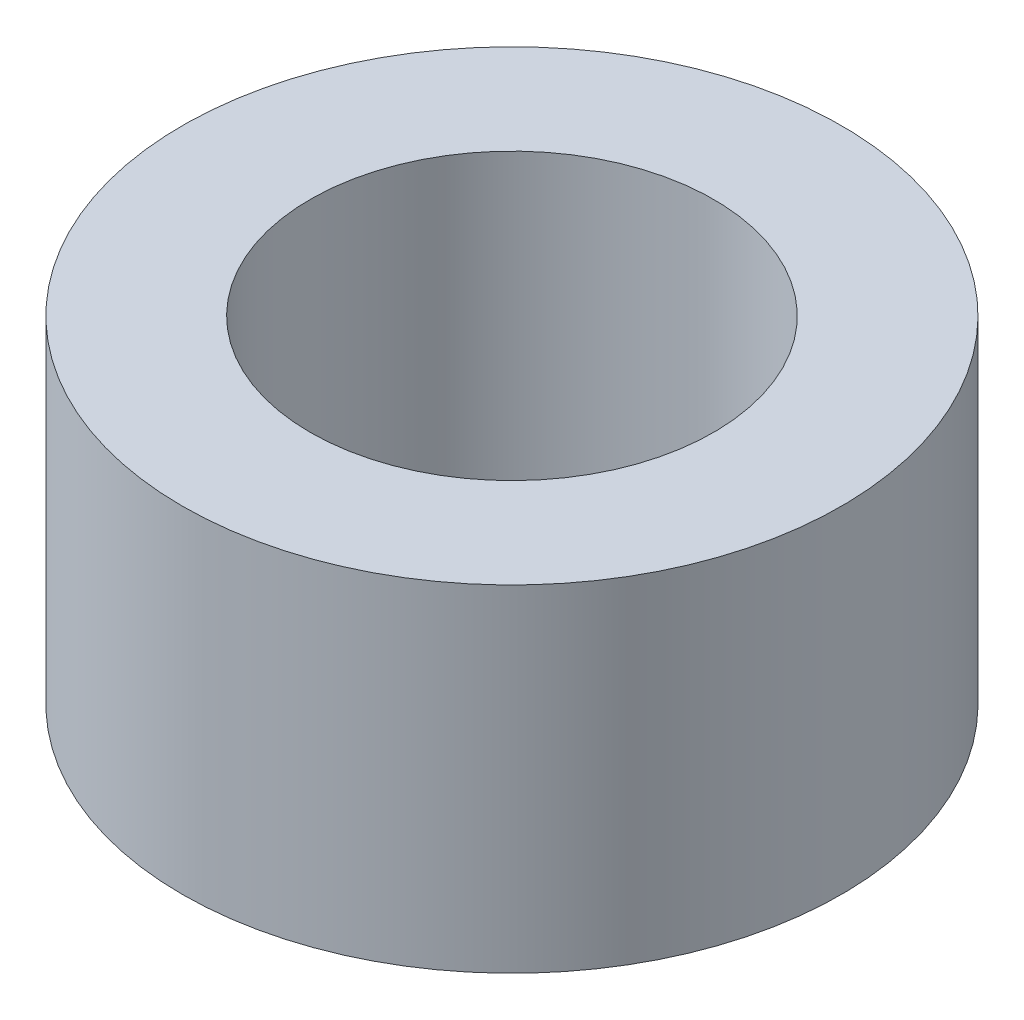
from build123d import *

# Parameters (mm, degrees)
SKETCH1_R          = 12.446
SKETCH1_R_2        = 7.62
BASE_EXTRUDE_DEPTH = 12.7


with BuildPart() as part:
    # Sketch1 → Base-Extrude (new body)
    with BuildSketch(Plane(origin=(0, 0, 0), x_dir=(1, 0, 0), z_dir=(0, 1, 0))):
        with Locations(Location((0, 0, 0), (0, 0, 270))):
            Circle(SKETCH1_R)
        with Locations(Location((0, 0, 0), (0, 0, 270))):
            Circle(SKETCH1_R_2, mode=Mode.SUBTRACT)
    extrude(amount=BASE_EXTRUDE_DEPTH)


solid = part.part
